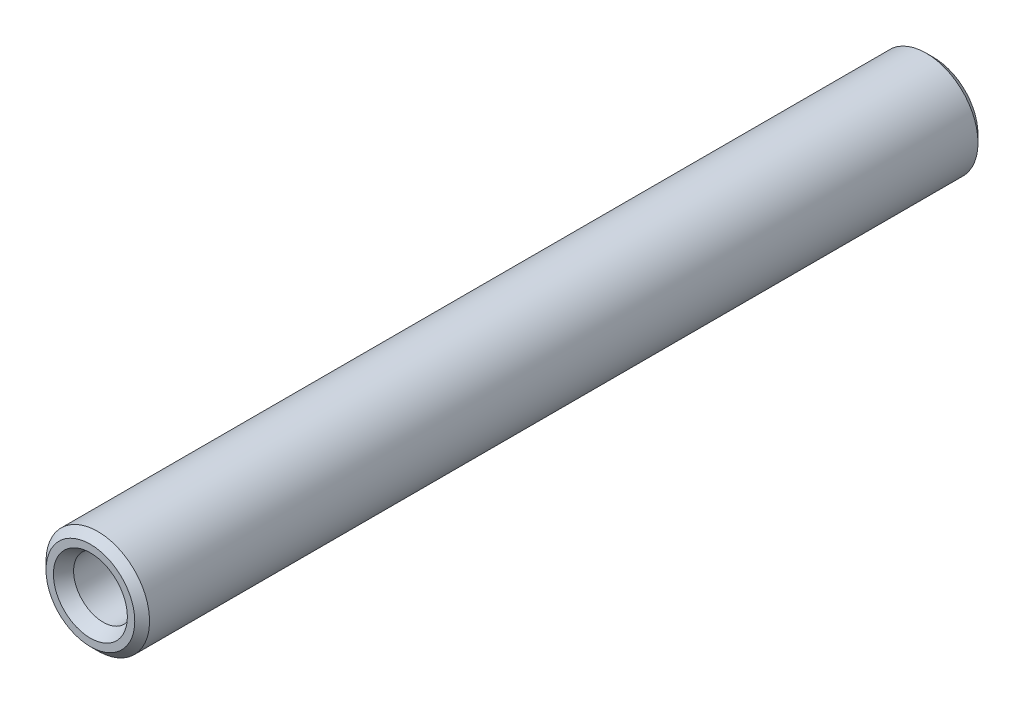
from build123d import *
from OCP.BRepFilletAPI import BRepFilletAPI_MakeChamfer

# Parameters (mm, degrees)
SKICA1_R                 = 7
P_IDAT_VYSUNUT_M1_DEPTH  = 114
SKICA2_R                 = 4
ODEBRAT_VYSUNUT_M1_DEPTH = 15
ODEBRAT_START            = -15
SKICA3_R                 = 4
ODEBRAT_VYSUNUT_M2_DEPTH = 15
ZKOSEN_1_SIZE            = 1
ZKOSEN_2_SIZE            = 1
ZKOSEN_2_SIZE2           = 1.732050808


with BuildPart() as part:
    # Skica1 → P_idat vysunut_m1 (new body)
    with BuildSketch(Plane.XY):
        with Locations(Location((0, 0, 0), (0, 0, 180))):
            Circle(SKICA1_R)
    extrude(amount=P_IDAT_VYSUNUT_M1_DEPTH)

    # Skica2 → Odebrat vysunut_m1 (cut)
    with BuildSketch(Plane.XY.offset(114)):
        Circle(SKICA2_R)
    extrude(amount=-ODEBRAT_VYSUNUT_M1_DEPTH, mode=Mode.SUBTRACT)

    # Skica3 → Odebrat vysunut_m2 (cut)
    with BuildSketch(Plane(origin=(0, 0, 0), x_dir=(-1, 0, 0), z_dir=(0, 0, -1)).offset(ODEBRAT_START)):
        with Locations(Location((0, 0, 0), (0, 0, 180))):
            Circle(SKICA3_R)
    extrude(amount=ODEBRAT_VYSUNUT_M2_DEPTH, mode=Mode.SUBTRACT)

    # Zkosen_1
    zkosen_1_edges = [part.edges().sort_by_distance(p)[0] for p in [
        (7, 0, 0),
        (7, 0, 114),
    ]]
    chamfer(zkosen_1_edges, length=ZKOSEN_1_SIZE)

    # Zkosen_2: one chamfer whose edges measure the first distance from different faces: ONE call of the kernel's chamfer builder (chamfer() names one face for all edges)
    zkosen_2_edges_1 = [part.edges().sort_by_distance(p)[0] for p in [
        (-4, 0, 0),
    ]]
    zkosen_2_side_1 = [part.faces().sort_by_distance(p)[0] for p in [
        (5.830294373, 0, 0),
    ]]
    zkosen_2_edges_2 = [part.edges().sort_by_distance(p)[0] for p in [
        (-4, 0, 114),
    ]]
    zkosen_2_side_2 = [part.faces().sort_by_distance(p)[0] for p in [
        (5.830294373, 0, 114),
    ]]
    zkosen_2 = BRepFilletAPI_MakeChamfer(part.part.solid().wrapped)
    for e in zkosen_2_edges_1:
        zkosen_2.Add(ZKOSEN_2_SIZE, ZKOSEN_2_SIZE2, e.wrapped, zkosen_2_side_1[0].wrapped)  # the first distance lies on this face
    for e in zkosen_2_edges_2:
        zkosen_2.Add(ZKOSEN_2_SIZE, ZKOSEN_2_SIZE2, e.wrapped, zkosen_2_side_2[0].wrapped)  # the first distance lies on this face
    add(Compound.cast(zkosen_2.Shape()), mode=Mode.REPLACE)


solid = part.part
